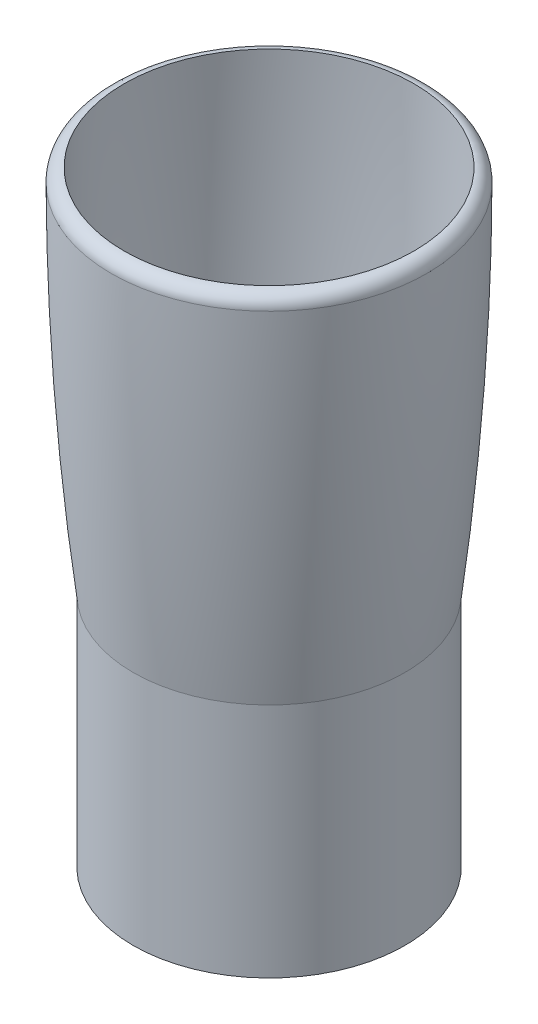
ISO-10303-21;
HEADER;
FILE_DESCRIPTION(('STEP AP214'),'2;1');
FILE_NAME('part.step','',(''),(''),'','','');
FILE_SCHEMA(('AUTOMOTIVE_DESIGN { 1 0 10303 214 1 1 1 1 }'));
ENDSEC;
DATA;
#1=APPLICATION_CONTEXT('core data for automotive mechanical design processes');
#2=APPLICATION_PROTOCOL_DEFINITION('international standard','automotive_design',2000,#1);
#3=PRODUCT_CONTEXT('',#1,'mechanical');
#4=PRODUCT('Part','Part','',(#3));
#5=PRODUCT_RELATED_PRODUCT_CATEGORY('part','',(#4));
#6=PRODUCT_DEFINITION_FORMATION('','',#4);
#7=PRODUCT_DEFINITION_CONTEXT('part definition',#1,'design');
#8=PRODUCT_DEFINITION('design','',#6,#7);
#9=PRODUCT_DEFINITION_SHAPE('','',#8);
#10=(LENGTH_UNIT() NAMED_UNIT(*) SI_UNIT(.MILLI.,.METRE.));
#11=(NAMED_UNIT(*) PLANE_ANGLE_UNIT() SI_UNIT($,.RADIAN.));
#12=(NAMED_UNIT(*) SI_UNIT($,.STERADIAN.) SOLID_ANGLE_UNIT());
#13=UNCERTAINTY_MEASURE_WITH_UNIT(LENGTH_MEASURE(1.E-05),#10,'distance_accuracy_value','');
#14=(GEOMETRIC_REPRESENTATION_CONTEXT(3) GLOBAL_UNCERTAINTY_ASSIGNED_CONTEXT((#13)) GLOBAL_UNIT_ASSIGNED_CONTEXT((#10,
#11,#12)) REPRESENTATION_CONTEXT('',''));
#15=CARTESIAN_POINT('',(0.,0.,0.));
#16=DIRECTION('',(0.,0.,1.));
#17=DIRECTION('',(1.,0.,0.));
#18=AXIS2_PLACEMENT_3D('',#15,#16,#17);
#19=CARTESIAN_POINT('',(0.,152.756378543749,0.));
#20=DIRECTION('',(0.,-1.,0.));
#21=DIRECTION('',(0.,0.,-1.));
#22=AXIS2_PLACEMENT_3D('',#19,#20,#21);
#23=DEGENERATE_TOROIDAL_SURFACE('',#22,750.225105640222,789.992758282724,.F.);
#24=CARTESIAN_POINT('',(0.,149.443532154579,0.));
#25=DIRECTION('',(0.,1.,0.));
#26=DIRECTION('',(0.,0.,1.));
#27=AXIS2_PLACEMENT_3D('',#24,#25,#26);
#28=CIRCLE('',#27,39.7607063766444);
#29=CARTESIAN_POINT('',(0.,149.443532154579,39.7607063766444));
#30=VERTEX_POINT('',#29);
#31=EDGE_CURVE('E10',#30,#30,#28,.F.);
#32=ORIENTED_EDGE('',*,*,#31,.T.);
#33=EDGE_LOOP('',(#32));
#34=FACE_BOUND('',#33,.T.);
#35=CARTESIAN_POINT('',(0.,59.5941825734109,0.));
#36=DIRECTION('',(0.,-1.,0.));
#37=DIRECTION('',(0.,0.,-1.));
#38=AXIS2_PLACEMENT_3D('',#35,#36,#37);
#39=CIRCLE('',#38,34.2552085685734);
#40=CARTESIAN_POINT('',(0.,59.5941825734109,-34.2552085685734));
#41=VERTEX_POINT('',#40);
#42=EDGE_CURVE('E52',#41,#41,#39,.T.);
#43=ORIENTED_EDGE('',*,*,#42,.F.);
#44=EDGE_LOOP('',(#43));
#45=FACE_BOUND('',#44,.T.);
#46=ADVANCED_FACE('F29',(#34,#45),#23,.F.);
#47=CARTESIAN_POINT('',(0.,152.756378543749,0.));
#48=DIRECTION('',(0.,-1.,0.));
#49=DIRECTION('',(0.,0.,-1.));
#50=AXIS2_PLACEMENT_3D('',#47,#48,#49);
#51=DEGENERATE_TOROIDAL_SURFACE('',#50,750.225105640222,786.766758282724,.F.);
#52=CARTESIAN_POINT('',(0.,152.756378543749,0.));
#53=DIRECTION('',(0.,-1.,0.));
#54=DIRECTION('',(0.,0.,-1.));
#55=AXIS2_PLACEMENT_3D('',#52,#53,#54);
#56=CIRCLE('',#55,36.5416526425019);
#57=CARTESIAN_POINT('',(0.,152.756378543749,-36.5416526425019));
#58=VERTEX_POINT('',#57);
#59=EDGE_CURVE('E36',#58,#58,#56,.T.);
#60=ORIENTED_EDGE('',*,*,#59,.F.);
#61=EDGE_LOOP('',(#60));
#62=FACE_BOUND('',#61,.T.);
#63=CARTESIAN_POINT('',(0.,59.7852622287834,0.));
#64=DIRECTION('',(0.,-1.,0.));
#65=DIRECTION('',(0.,0.,-1.));
#66=AXIS2_PLACEMENT_3D('',#63,#64,#65);
#67=CIRCLE('',#66,31.0292085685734);
#68=CARTESIAN_POINT('',(0.,59.7852622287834,-31.0292085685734));
#69=VERTEX_POINT('',#68);
#70=EDGE_CURVE('E40',#69,#69,#67,.T.);
#71=ORIENTED_EDGE('',*,*,#70,.T.);
#72=EDGE_LOOP('',(#71));
#73=FACE_BOUND('',#72,.T.);
#74=ADVANCED_FACE('F60',(#62,#73),#51,.T.);
#75=CARTESIAN_POINT('',(0.,0.,0.));
#76=DIRECTION('',(0.,-1.,0.));
#77=DIRECTION('',(0.,0.,-1.));
#78=AXIS2_PLACEMENT_3D('',#75,#76,#77);
#79=CYLINDRICAL_SURFACE('',#78,31.0292085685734);
#80=ORIENTED_EDGE('',*,*,#70,.F.);
#81=EDGE_LOOP('',(#80));
#82=FACE_BOUND('',#81,.T.);
#83=CARTESIAN_POINT('',(0.,0.,0.));
#84=DIRECTION('',(0.,-1.,0.));
#85=DIRECTION('',(0.,0.,-1.));
#86=AXIS2_PLACEMENT_3D('',#83,#84,#85);
#87=CIRCLE('',#86,31.0292085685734);
#88=CARTESIAN_POINT('',(0.,0.,-31.0292085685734));
#89=VERTEX_POINT('',#88);
#90=EDGE_CURVE('E44',#89,#89,#87,.T.);
#91=ORIENTED_EDGE('',*,*,#90,.T.);
#92=EDGE_LOOP('',(#91));
#93=FACE_BOUND('',#92,.T.);
#94=ADVANCED_FACE('F64',(#82,#93),#79,.F.);
#95=CARTESIAN_POINT('',(34.2552085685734,0.,0.));
#96=DIRECTION('',(0.,1.,0.));
#97=DIRECTION('',(0.,0.,1.));
#98=AXIS2_PLACEMENT_3D('',#95,#96,#97);
#99=PLANE('',#98);
#100=ORIENTED_EDGE('',*,*,#90,.F.);
#101=EDGE_LOOP('',(#100));
#102=FACE_BOUND('',#101,.T.);
#103=CARTESIAN_POINT('',(0.,0.,0.));
#104=DIRECTION('',(0.,-1.,0.));
#105=DIRECTION('',(0.,0.,-1.));
#106=AXIS2_PLACEMENT_3D('',#103,#104,#105);
#107=CIRCLE('',#106,34.2552085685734);
#108=CARTESIAN_POINT('',(0.,0.,-34.2552085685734));
#109=VERTEX_POINT('',#108);
#110=EDGE_CURVE('E49',#109,#109,#107,.T.);
#111=ORIENTED_EDGE('',*,*,#110,.T.);
#112=EDGE_LOOP('',(#111));
#113=FACE_BOUND('',#112,.T.);
#114=ADVANCED_FACE('F70',(#102,#113),#99,.F.);
#115=CARTESIAN_POINT('',(0.,0.,0.));
#116=DIRECTION('',(0.,-1.,0.));
#117=DIRECTION('',(0.,0.,-1.));
#118=AXIS2_PLACEMENT_3D('',#115,#116,#117);
#119=CYLINDRICAL_SURFACE('',#118,34.2552085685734);
#120=ORIENTED_EDGE('',*,*,#42,.T.);
#121=EDGE_LOOP('',(#120));
#122=FACE_BOUND('',#121,.T.);
#123=ORIENTED_EDGE('',*,*,#110,.F.);
#124=EDGE_LOOP('',(#123));
#125=FACE_BOUND('',#124,.T.);
#126=ADVANCED_FACE('F56',(#122,#125),#119,.T.);
#127=CARTESIAN_POINT('',(0.,149.457370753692,0.));
#128=DIRECTION('',(0.,1.,0.));
#129=DIRECTION('',(0.,0.,1.));
#130=AXIS2_PLACEMENT_3D('',#127,#128,#129);
#131=TOROIDAL_SURFACE('',#130,36.4607353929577,3.3);
#132=ORIENTED_EDGE('',*,*,#59,.T.);
#133=EDGE_LOOP('',(#132));
#134=FACE_BOUND('',#133,.T.);
#135=ORIENTED_EDGE('',*,*,#31,.F.);
#136=EDGE_LOOP('',(#135));
#137=FACE_BOUND('',#136,.T.);
#138=ADVANCED_FACE('F31',(#134,#137),#131,.T.);
#139=CLOSED_SHELL('',(#46,#74,#94,#114,#126,#138));
#140=MANIFOLD_SOLID_BREP('B2',#139);
#141=ADVANCED_BREP_SHAPE_REPRESENTATION('',(#18,#140),#14);
#142=SHAPE_DEFINITION_REPRESENTATION(#9,#141);
ENDSEC;
END-ISO-10303-21;
